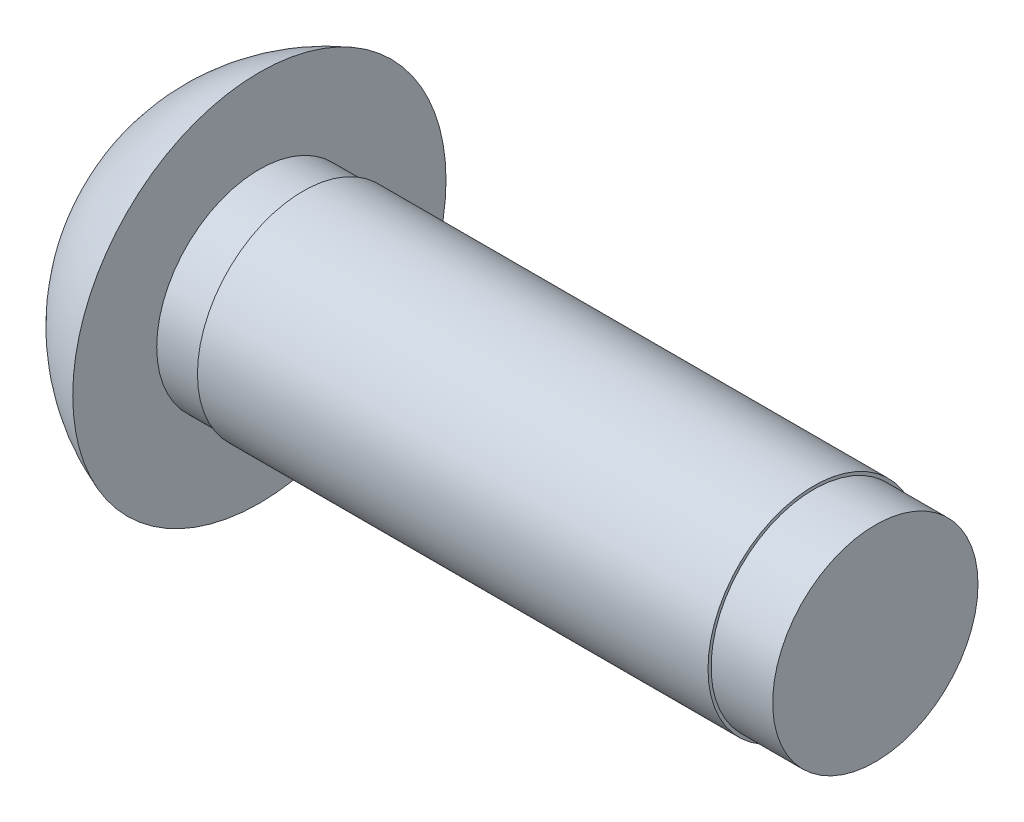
from build123d import *

# Parameters (mm, degrees)
SKETCH2_R      = 2.575
BASEBODY_DEPTH = 13.933333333
SKETCH3_W      = 1.5
SKETCH3_H      = 6


with BuildPart() as part:
    # Sketch1 → BaseHead (revolve)
    with BuildSketch(Plane.XY, mode=Mode.PRIVATE) as basehead_sk:
        with BuildLine():
            Line((18.2, 0), (18.2, 2.5))
            Line((18.2, 2.5), (3.2, 2.5))
            Line((3.2, 2.5), (3.2, 4.545))
            ThreePointArc((3.2, 4.545), (0.880250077, 2.779254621), (0, 0))
            Line((0, 0), (18.2, 0))
        make_face()
    revolve(basehead_sk.sketch.rotate(Axis((-21.423653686, 0, 0), (1, 0, 0)), 90), axis=Axis((-21.423653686, 0, 0), (1, 0, 0)))

    # Sketch2 → BaseBody (add)
    with BuildSketch(Plane(origin=(18.2, 0.805146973, 1.172220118), x_dir=(0, 0, -1), z_dir=(1, 0, 0))):
        with Locations((1.172220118, -0.805146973)):
            Circle(SKETCH2_R)
    extrude(amount=-BASEBODY_DEPTH)

    # Sketch3 → Cut-Revolve1 (revolve, cut)
    with BuildSketch(Plane.XY, mode=Mode.PRIVATE) as cut_revolve1_sk:
        with Locations((17.45, 5.5)):
            Rectangle(SKETCH3_W, SKETCH3_H)
    revolve(cut_revolve1_sk.sketch.rotate(Axis((0.813407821, 0, 0), (-1, 0, 0)), 90), axis=Axis((0.813407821, 0, 0), (-1, 0, 0)), mode=Mode.SUBTRACT)


solid = part.part
